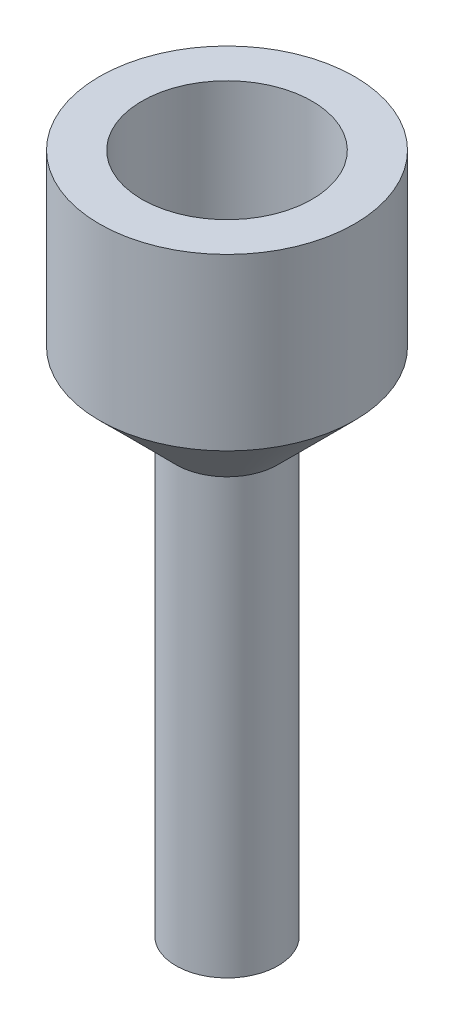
from build123d import *

# Parameters (mm, degrees)
M20_0_20_000000_DIAMETER_HOLE1_D     = 20
M20_0_20_000000_DIAMETER_HOLE1_DEPTH = 15
M20_0_20_000000_DIAMETER_HOLE1_TIP   = 6.00860619
M6_TAPPED_HOLE1_D                    = 5
M6_TAPPED_HOLE1_DEPTH                = 15
M6_TAPPED_HOLE1_TIP                  = 1.502151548


with BuildPart() as part:
    # Sketch1 → Revolve1 (revolve)
    with BuildSketch(Plane.XY, mode=Mode.PRIVATE) as revolve1_sk:
        Polygon((0, 0), (6, 0), (6, 51), (15, 60), (15, 80), (0, 80), align=None)
    revolve(revolve1_sk.sketch.rotate(Axis((0, 80, 0), (0, -1, 0)), 180), axis=Axis((0, 80, 0), (0, -1, 0)))

    # M20.0 _20.000000_ Diameter Hole1
    with Locations(Plane(origin=(0, 80, 0), x_dir=(1, 0, 0), z_dir=(0, 1, 0))):
        with Locations((0, 0)):
            Hole(M20_0_20_000000_DIAMETER_HOLE1_D / 2, depth=M20_0_20_000000_DIAMETER_HOLE1_DEPTH)
            with Locations((0, 0, -(M20_0_20_000000_DIAMETER_HOLE1_DEPTH + M20_0_20_000000_DIAMETER_HOLE1_TIP / 2))):  # 118° drill point
                Cone(0, M20_0_20_000000_DIAMETER_HOLE1_D / 2, M20_0_20_000000_DIAMETER_HOLE1_TIP, mode=Mode.SUBTRACT)

    # M6 Tapped Hole1
    with Locations(Plane(origin=(0, 0, 0), x_dir=(-1, 0, 0), z_dir=(0, -1, 0))):
        with Locations((0, 0)):
            Hole(M6_TAPPED_HOLE1_D / 2, depth=M6_TAPPED_HOLE1_DEPTH)
            with Locations((0, 0, -(M6_TAPPED_HOLE1_DEPTH + M6_TAPPED_HOLE1_TIP / 2))):  # 118° drill point
                Cone(0, M6_TAPPED_HOLE1_D / 2, M6_TAPPED_HOLE1_TIP, mode=Mode.SUBTRACT)


solid = part.part
